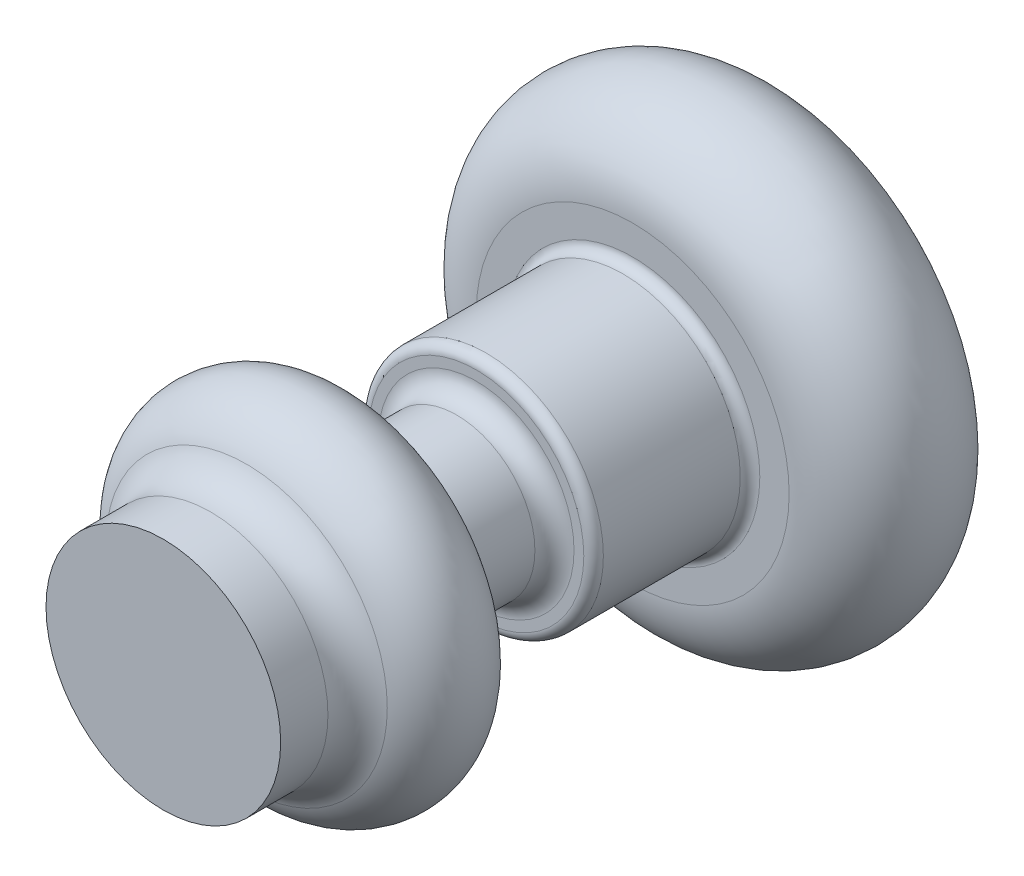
from build123d import *


with BuildPart() as part:
    # Sketch1 → Revolve1 (revolve)
    with BuildSketch(Plane(origin=(0, 0, 0), x_dir=(1, 0, 0), z_dir=(0, 1, 0))):
        with BuildLine():
            Line((40.8, 81.6), (0, 81.6))
            Line((0, 81.6), (0, -81.6))
            Line((0, -81.6), (30.6, -81.6))
            Line((30.6, -81.6), (30.6, -69.271136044))
            ThreePointArc((30.6, -69.271136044), (32.266067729, -63.684365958), (36.72, -59.922681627))
            ThreePointArc((36.72, -59.922681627), (45.577266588, -42.774062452), (30.6, -30.6))
            ThreePointArc((30.6, -30.6), (23.387510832, -27.612489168), (20.4, -20.4))
            Line((20.4, -20.4), (20.4, -5.1))
            ThreePointArc((20.4, -5.1), (21.893755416, -1.493755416), (25.5, 0))
            Line((25.5, 0), (28.05, 0))
            ThreePointArc((28.05, 0), (29.853122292, 0.746877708), (30.6, 2.55))
            Line((30.6, 2.55), (30.6, 38.25))
            ThreePointArc((30.6, 38.25), (31.346877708, 40.053122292), (33.15, 40.8))
            Line((33.15, 40.8), (40.8, 40.8))
            ThreePointArc((40.8, 40.8), (61.2, 61.2), (40.8, 81.6))
        make_face()
    revolve(axis=Axis((0, 0, 81.6), (0, 0, -1)))


solid = part.part
